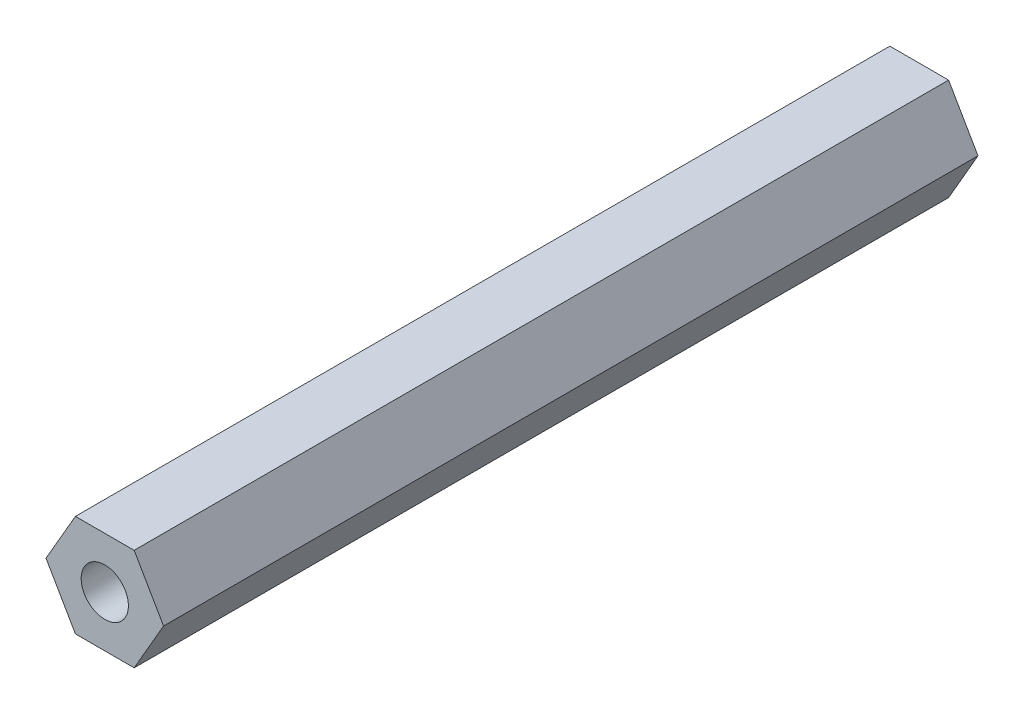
ISO-10303-21;
HEADER;
FILE_DESCRIPTION(('STEP AP214'),'2;1');
FILE_NAME('part.step','',(''),(''),'','','');
FILE_SCHEMA(('AUTOMOTIVE_DESIGN { 1 0 10303 214 1 1 1 1 }'));
ENDSEC;
DATA;
#1=APPLICATION_CONTEXT('core data for automotive mechanical design processes');
#2=APPLICATION_PROTOCOL_DEFINITION('international standard','automotive_design',2000,#1);
#3=PRODUCT_CONTEXT('',#1,'mechanical');
#4=PRODUCT('Part','Part','',(#3));
#5=PRODUCT_RELATED_PRODUCT_CATEGORY('part','',(#4));
#6=PRODUCT_DEFINITION_FORMATION('','',#4);
#7=PRODUCT_DEFINITION_CONTEXT('part definition',#1,'design');
#8=PRODUCT_DEFINITION('design','',#6,#7);
#9=PRODUCT_DEFINITION_SHAPE('','',#8);
#10=(LENGTH_UNIT() NAMED_UNIT(*) SI_UNIT(.MILLI.,.METRE.));
#11=(NAMED_UNIT(*) PLANE_ANGLE_UNIT() SI_UNIT($,.RADIAN.));
#12=(NAMED_UNIT(*) SI_UNIT($,.STERADIAN.) SOLID_ANGLE_UNIT());
#13=UNCERTAINTY_MEASURE_WITH_UNIT(LENGTH_MEASURE(1.E-05),#10,'distance_accuracy_value','');
#14=(GEOMETRIC_REPRESENTATION_CONTEXT(3) GLOBAL_UNCERTAINTY_ASSIGNED_CONTEXT((#13)) GLOBAL_UNIT_ASSIGNED_CONTEXT((#10,
#11,#12)) REPRESENTATION_CONTEXT('',''));
#15=CARTESIAN_POINT('',(0.,0.,0.));
#16=DIRECTION('',(0.,0.,1.));
#17=DIRECTION('',(1.,0.,0.));
#18=AXIS2_PLACEMENT_3D('',#15,#16,#17);
#19=CARTESIAN_POINT('',(3.66617420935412,0.,50.8));
#20=DIRECTION('',(-0.866025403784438,-0.5,0.));
#21=DIRECTION('',(0.5,-0.866025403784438,0.));
#22=AXIS2_PLACEMENT_3D('',#19,#20,#21);
#23=PLANE('',#22);
#24=DIRECTION('',(-0.5,0.866025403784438,0.));
#25=VECTOR('',#24,1.);
#26=CARTESIAN_POINT('',(3.66617420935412,0.,0.));
#27=LINE('',#26,#25);
#28=CARTESIAN_POINT('',(3.66617420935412,0.,0.));
#29=VERTEX_POINT('',#28);
#30=CARTESIAN_POINT('',(1.83308710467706,3.175,0.));
#31=VERTEX_POINT('',#30);
#32=EDGE_CURVE('E117',#29,#31,#27,.T.);
#33=ORIENTED_EDGE('',*,*,#32,.T.);
#34=DIRECTION('',(0.,0.,-1.));
#35=VECTOR('',#34,1.);
#36=CARTESIAN_POINT('',(1.83308710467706,3.175,50.8));
#37=LINE('',#36,#35);
#38=CARTESIAN_POINT('',(1.83308710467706,3.175,50.8));
#39=VERTEX_POINT('',#38);
#40=EDGE_CURVE('E11',#39,#31,#37,.T.);
#41=ORIENTED_EDGE('',*,*,#40,.F.);
#42=DIRECTION('',(-0.5,0.866025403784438,0.));
#43=VECTOR('',#42,1.);
#44=CARTESIAN_POINT('',(3.66617420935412,0.,50.8));
#45=LINE('',#44,#43);
#46=CARTESIAN_POINT('',(3.66617420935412,0.,50.8));
#47=VERTEX_POINT('',#46);
#48=EDGE_CURVE('E128',#47,#39,#45,.T.);
#49=ORIENTED_EDGE('',*,*,#48,.F.);
#50=DIRECTION('',(0.,0.,-1.));
#51=VECTOR('',#50,1.);
#52=CARTESIAN_POINT('',(3.66617420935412,0.,50.8));
#53=LINE('',#52,#51);
#54=EDGE_CURVE('E113',#47,#29,#53,.T.);
#55=ORIENTED_EDGE('',*,*,#54,.T.);
#56=EDGE_LOOP('',(#33,#41,#49,#55));
#57=FACE_BOUND('',#56,.T.);
#58=ADVANCED_FACE('F33',(#57),#23,.F.);
#59=CARTESIAN_POINT('',(1.83308710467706,3.175,50.8));
#60=DIRECTION('',(0.,-1.,0.));
#61=DIRECTION('',(0.,0.,-1.));
#62=AXIS2_PLACEMENT_3D('',#59,#60,#61);
#63=PLANE('',#62);
#64=DIRECTION('',(-1.,0.,0.));
#65=VECTOR('',#64,1.);
#66=CARTESIAN_POINT('',(1.83308710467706,3.175,0.));
#67=LINE('',#66,#65);
#68=CARTESIAN_POINT('',(-1.83308710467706,3.175,0.));
#69=VERTEX_POINT('',#68);
#70=EDGE_CURVE('E120',#31,#69,#67,.T.);
#71=ORIENTED_EDGE('',*,*,#70,.T.);
#72=DIRECTION('',(0.,0.,-1.));
#73=VECTOR('',#72,1.);
#74=CARTESIAN_POINT('',(-1.83308710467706,3.175,50.8));
#75=LINE('',#74,#73);
#76=CARTESIAN_POINT('',(-1.83308710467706,3.175,50.8));
#77=VERTEX_POINT('',#76);
#78=EDGE_CURVE('E41',#77,#69,#75,.T.);
#79=ORIENTED_EDGE('',*,*,#78,.F.);
#80=DIRECTION('',(-1.,0.,0.));
#81=VECTOR('',#80,1.);
#82=CARTESIAN_POINT('',(1.83308710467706,3.175,50.8));
#83=LINE('',#82,#81);
#84=EDGE_CURVE('E86',#39,#77,#83,.T.);
#85=ORIENTED_EDGE('',*,*,#84,.F.);
#86=ORIENTED_EDGE('',*,*,#40,.T.);
#87=EDGE_LOOP('',(#71,#79,#85,#86));
#88=FACE_BOUND('',#87,.T.);
#89=ADVANCED_FACE('F153',(#88),#63,.F.);
#90=CARTESIAN_POINT('',(-1.83308710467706,3.175,50.8));
#91=DIRECTION('',(0.866025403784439,-0.5,0.));
#92=DIRECTION('',(0.5,0.866025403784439,0.));
#93=AXIS2_PLACEMENT_3D('',#90,#91,#92);
#94=PLANE('',#93);
#95=DIRECTION('',(-0.5,-0.866025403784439,0.));
#96=VECTOR('',#95,1.);
#97=CARTESIAN_POINT('',(-1.83308710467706,3.175,0.));
#98=LINE('',#97,#96);
#99=CARTESIAN_POINT('',(-3.66617420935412,0.,0.));
#100=VERTEX_POINT('',#99);
#101=EDGE_CURVE('E123',#69,#100,#98,.T.);
#102=ORIENTED_EDGE('',*,*,#101,.T.);
#103=DIRECTION('',(0.,0.,-1.));
#104=VECTOR('',#103,1.);
#105=CARTESIAN_POINT('',(-3.66617420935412,0.,50.8));
#106=LINE('',#105,#104);
#107=CARTESIAN_POINT('',(-3.66617420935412,0.,50.8));
#108=VERTEX_POINT('',#107);
#109=EDGE_CURVE('E108',#108,#100,#106,.T.);
#110=ORIENTED_EDGE('',*,*,#109,.F.);
#111=DIRECTION('',(-0.5,-0.866025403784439,0.));
#112=VECTOR('',#111,1.);
#113=CARTESIAN_POINT('',(-1.83308710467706,3.175,50.8));
#114=LINE('',#113,#112);
#115=EDGE_CURVE('E99',#77,#108,#114,.T.);
#116=ORIENTED_EDGE('',*,*,#115,.F.);
#117=ORIENTED_EDGE('',*,*,#78,.T.);
#118=EDGE_LOOP('',(#102,#110,#116,#117));
#119=FACE_BOUND('',#118,.T.);
#120=ADVANCED_FACE('F134',(#119),#94,.F.);
#121=CARTESIAN_POINT('',(-3.66617420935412,0.,50.8));
#122=DIRECTION('',(0.866025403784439,0.5,0.));
#123=DIRECTION('',(-0.5,0.866025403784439,0.));
#124=AXIS2_PLACEMENT_3D('',#121,#122,#123);
#125=PLANE('',#124);
#126=DIRECTION('',(0.5,-0.866025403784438,0.));
#127=VECTOR('',#126,1.);
#128=CARTESIAN_POINT('',(-3.66617420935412,0.,0.));
#129=LINE('',#128,#127);
#130=CARTESIAN_POINT('',(-1.83308710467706,-3.175,0.));
#131=VERTEX_POINT('',#130);
#132=EDGE_CURVE('E107',#100,#131,#129,.T.);
#133=ORIENTED_EDGE('',*,*,#132,.T.);
#134=DIRECTION('',(0.,0.,-1.));
#135=VECTOR('',#134,1.);
#136=CARTESIAN_POINT('',(-1.83308710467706,-3.175,50.8));
#137=LINE('',#136,#135);
#138=CARTESIAN_POINT('',(-1.83308710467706,-3.175,50.8));
#139=VERTEX_POINT('',#138);
#140=EDGE_CURVE('E104',#139,#131,#137,.T.);
#141=ORIENTED_EDGE('',*,*,#140,.F.);
#142=DIRECTION('',(0.5,-0.866025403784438,0.));
#143=VECTOR('',#142,1.);
#144=CARTESIAN_POINT('',(-3.66617420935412,0.,50.8));
#145=LINE('',#144,#143);
#146=EDGE_CURVE('E93',#108,#139,#145,.T.);
#147=ORIENTED_EDGE('',*,*,#146,.F.);
#148=ORIENTED_EDGE('',*,*,#109,.T.);
#149=EDGE_LOOP('',(#133,#141,#147,#148));
#150=FACE_BOUND('',#149,.T.);
#151=ADVANCED_FACE('F105',(#150),#125,.F.);
#152=CARTESIAN_POINT('',(-1.83308710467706,-3.175,50.8));
#153=DIRECTION('',(0.,1.,0.));
#154=DIRECTION('',(-1.,0.,0.));
#155=AXIS2_PLACEMENT_3D('',#152,#153,#154);
#156=PLANE('',#155);
#157=DIRECTION('',(1.,0.,0.));
#158=VECTOR('',#157,1.);
#159=CARTESIAN_POINT('',(-1.83308710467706,-3.175,0.));
#160=LINE('',#159,#158);
#161=CARTESIAN_POINT('',(1.83308710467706,-3.175,0.));
#162=VERTEX_POINT('',#161);
#163=EDGE_CURVE('E72',#131,#162,#160,.T.);
#164=ORIENTED_EDGE('',*,*,#163,.T.);
#165=DIRECTION('',(0.,0.,-1.));
#166=VECTOR('',#165,1.);
#167=CARTESIAN_POINT('',(1.83308710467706,-3.175,50.8));
#168=LINE('',#167,#166);
#169=CARTESIAN_POINT('',(1.83308710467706,-3.175,50.8));
#170=VERTEX_POINT('',#169);
#171=EDGE_CURVE('E109',#170,#162,#168,.T.);
#172=ORIENTED_EDGE('',*,*,#171,.F.);
#173=DIRECTION('',(1.,0.,0.));
#174=VECTOR('',#173,1.);
#175=CARTESIAN_POINT('',(-1.83308710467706,-3.175,50.8));
#176=LINE('',#175,#174);
#177=EDGE_CURVE('E97',#139,#170,#176,.T.);
#178=ORIENTED_EDGE('',*,*,#177,.F.);
#179=ORIENTED_EDGE('',*,*,#140,.T.);
#180=EDGE_LOOP('',(#164,#172,#178,#179));
#181=FACE_BOUND('',#180,.T.);
#182=ADVANCED_FACE('F111',(#181),#156,.F.);
#183=CARTESIAN_POINT('',(1.83308710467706,-3.175,50.8));
#184=DIRECTION('',(-0.866025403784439,0.5,0.));
#185=DIRECTION('',(-0.5,-0.866025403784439,0.));
#186=AXIS2_PLACEMENT_3D('',#183,#184,#185);
#187=PLANE('',#186);
#188=DIRECTION('',(0.5,0.866025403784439,0.));
#189=VECTOR('',#188,1.);
#190=CARTESIAN_POINT('',(1.83308710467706,-3.175,0.));
#191=LINE('',#190,#189);
#192=EDGE_CURVE('E78',#162,#29,#191,.T.);
#193=ORIENTED_EDGE('',*,*,#192,.T.);
#194=ORIENTED_EDGE('',*,*,#54,.F.);
#195=DIRECTION('',(0.5,0.866025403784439,0.));
#196=VECTOR('',#195,1.);
#197=CARTESIAN_POINT('',(1.83308710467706,-3.175,50.8));
#198=LINE('',#197,#196);
#199=EDGE_CURVE('E49',#170,#47,#198,.T.);
#200=ORIENTED_EDGE('',*,*,#199,.F.);
#201=ORIENTED_EDGE('',*,*,#171,.T.);
#202=EDGE_LOOP('',(#193,#194,#200,#201));
#203=FACE_BOUND('',#202,.T.);
#204=ADVANCED_FACE('F141',(#203),#187,.F.);
#205=CARTESIAN_POINT('',(0.,0.,50.8));
#206=DIRECTION('',(0.,0.,1.));
#207=DIRECTION('',(1.,0.,0.));
#208=AXIS2_PLACEMENT_3D('',#205,#206,#207);
#209=PLANE('',#208);
#210=CARTESIAN_POINT('',(0.,0.,50.8));
#211=DIRECTION('',(0.,0.,1.));
#212=DIRECTION('',(1.,0.,0.));
#213=AXIS2_PLACEMENT_3D('',#210,#211,#212);
#214=CIRCLE('',#213,1.47319999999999);
#215=CARTESIAN_POINT('',(1.47319999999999,0.,50.8));
#216=VERTEX_POINT('',#215);
#217=EDGE_CURVE('E208',#216,#216,#214,.T.);
#218=ORIENTED_EDGE('',*,*,#217,.F.);
#219=EDGE_LOOP('',(#218));
#220=FACE_BOUND('',#219,.T.);
#221=ORIENTED_EDGE('',*,*,#48,.T.);
#222=ORIENTED_EDGE('',*,*,#84,.T.);
#223=ORIENTED_EDGE('',*,*,#115,.T.);
#224=ORIENTED_EDGE('',*,*,#146,.T.);
#225=ORIENTED_EDGE('',*,*,#177,.T.);
#226=ORIENTED_EDGE('',*,*,#199,.T.);
#227=EDGE_LOOP('',(#221,#222,#223,#224,#225,#226));
#228=FACE_BOUND('',#227,.T.);
#229=ADVANCED_FACE('F95',(#220,#228),#209,.T.);
#230=CARTESIAN_POINT('',(0.,0.,0.));
#231=DIRECTION('',(0.,0.,1.));
#232=DIRECTION('',(1.,0.,0.));
#233=AXIS2_PLACEMENT_3D('',#230,#231,#232);
#234=PLANE('',#233);
#235=CARTESIAN_POINT('',(0.,0.,0.));
#236=DIRECTION('',(0.,0.,1.));
#237=DIRECTION('',(1.,0.,0.));
#238=AXIS2_PLACEMENT_3D('',#235,#236,#237);
#239=CIRCLE('',#238,1.47319999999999);
#240=CARTESIAN_POINT('',(1.47319999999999,0.,0.));
#241=VERTEX_POINT('',#240);
#242=EDGE_CURVE('E121',#241,#241,#239,.T.);
#243=ORIENTED_EDGE('',*,*,#242,.T.);
#244=EDGE_LOOP('',(#243));
#245=FACE_BOUND('',#244,.T.);
#246=ORIENTED_EDGE('',*,*,#32,.F.);
#247=ORIENTED_EDGE('',*,*,#192,.F.);
#248=ORIENTED_EDGE('',*,*,#163,.F.);
#249=ORIENTED_EDGE('',*,*,#132,.F.);
#250=ORIENTED_EDGE('',*,*,#101,.F.);
#251=ORIENTED_EDGE('',*,*,#70,.F.);
#252=EDGE_LOOP('',(#246,#247,#248,#249,#250,#251));
#253=FACE_BOUND('',#252,.T.);
#254=ADVANCED_FACE('F137',(#245,#253),#234,.F.);
#255=CARTESIAN_POINT('',(0.,0.,50.8));
#256=DIRECTION('',(0.,0.,1.));
#257=DIRECTION('',(1.,0.,0.));
#258=AXIS2_PLACEMENT_3D('',#255,#256,#257);
#259=CYLINDRICAL_SURFACE('',#258,1.47319999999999);
#260=ORIENTED_EDGE('',*,*,#242,.F.);
#261=EDGE_LOOP('',(#260));
#262=FACE_BOUND('',#261,.T.);
#263=ORIENTED_EDGE('',*,*,#217,.T.);
#264=EDGE_LOOP('',(#263));
#265=FACE_BOUND('',#264,.T.);
#266=ADVANCED_FACE('F190',(#262,#265),#259,.F.);
#267=CLOSED_SHELL('',(#58,#89,#120,#151,#182,#204,#229,#254,#266));
#268=MANIFOLD_SOLID_BREP('B2',#267);
#269=ADVANCED_BREP_SHAPE_REPRESENTATION('',(#18,#268),#14);
#270=SHAPE_DEFINITION_REPRESENTATION(#9,#269);
ENDSEC;
END-ISO-10303-21;
